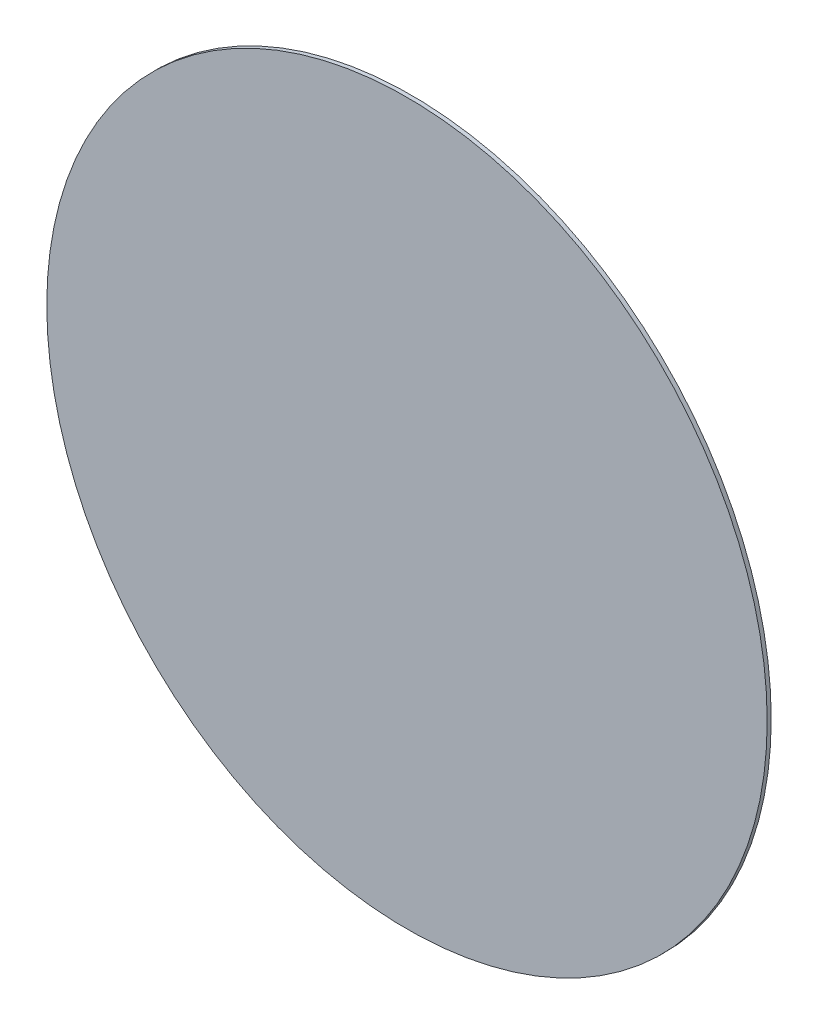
from build123d import *

# Parameters (mm, degrees)
SKETCH1_R      = 12.5
EXTRUDE1_DEPTH = 0.14


with BuildPart() as part:
    # Sketch1 → Extrude1 (new body)
    with BuildSketch(Plane.XY):
        Circle(SKETCH1_R)
    extrude(amount=EXTRUDE1_DEPTH)


solid = part.part
